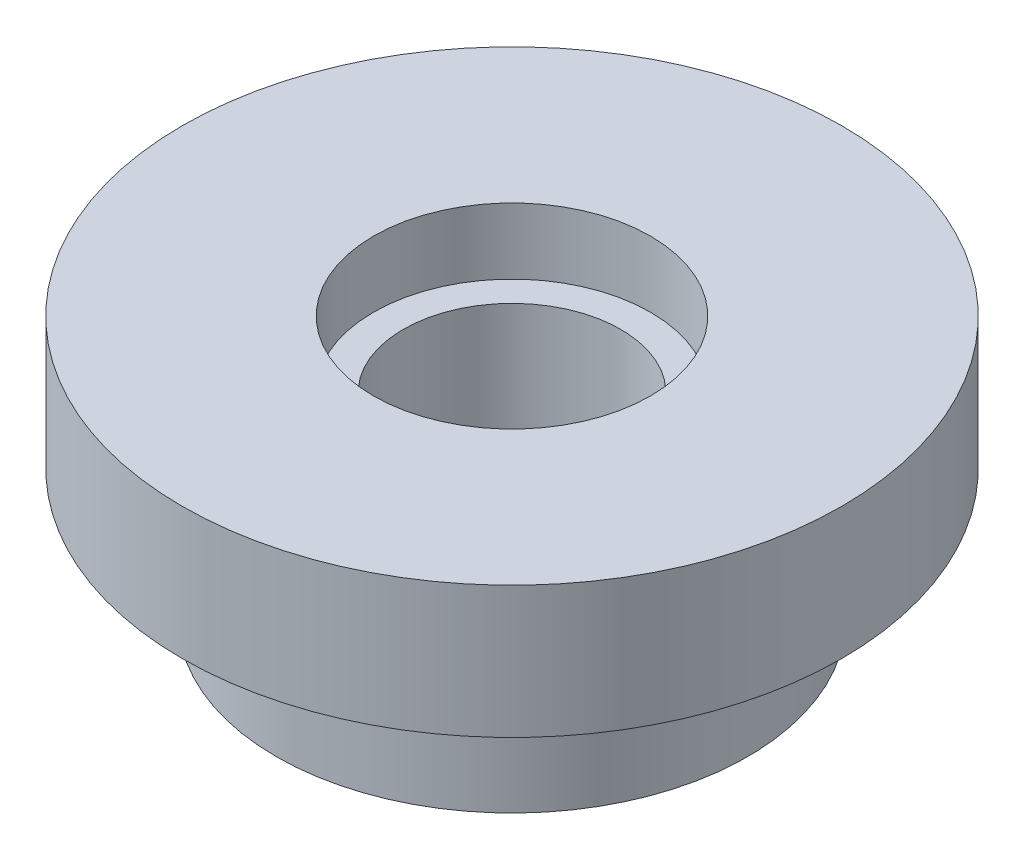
from build123d import *

# Parameters (mm, degrees)
SKETCH1_R         = 50
SKETCH1_R_2       = 16.5
EXTRUDE1_DEPTH    = 40
SKETCH2_R         = 21
EXTRUDE3_DEPTH    = 10
SKETCH7_OUTSIDE_W = 131.394
SKETCH7_OUTSIDE_H = 131.394
SKETCH7_OUTSIDE_R = 35.75
EXTRUDE4_DEPTH    = 20


with BuildPart() as part:
    # Sketch1 → Extrude1 (new body)
    with BuildSketch(Plane(origin=(0, 0, 0), x_dir=(1, 0, 0), z_dir=(0, 1, 0))):
        with Locations(Location((0, 0, 0), (0, 0, 270))):
            Circle(SKETCH1_R)
        with Locations(Location((0, 0, 0), (0, 0, 270))):
            Circle(SKETCH1_R_2, mode=Mode.SUBTRACT)
    extrude(amount=EXTRUDE1_DEPTH)

    # Sketch2 → Extrude3 (cut)
    with BuildSketch(Plane(origin=(0, 40, 0), x_dir=(1, 0, 0), z_dir=(0, 1, 0))):
        with Locations(Location((0, 0, 0), (0, 0, 270))):
            Circle(SKETCH2_R)
    extrude(amount=-EXTRUDE3_DEPTH, mode=Mode.SUBTRACT)

    # Sketch7 outside → Extrude4 (cut)
    with BuildSketch(Plane.XZ):
        Rectangle(SKETCH7_OUTSIDE_W, SKETCH7_OUTSIDE_H)
        with Locations(Location((0, 0, 0), (0, 0, 270))):
            Circle(SKETCH7_OUTSIDE_R, mode=Mode.SUBTRACT)
    extrude(amount=-EXTRUDE4_DEPTH, mode=Mode.SUBTRACT)


solid = part.part
